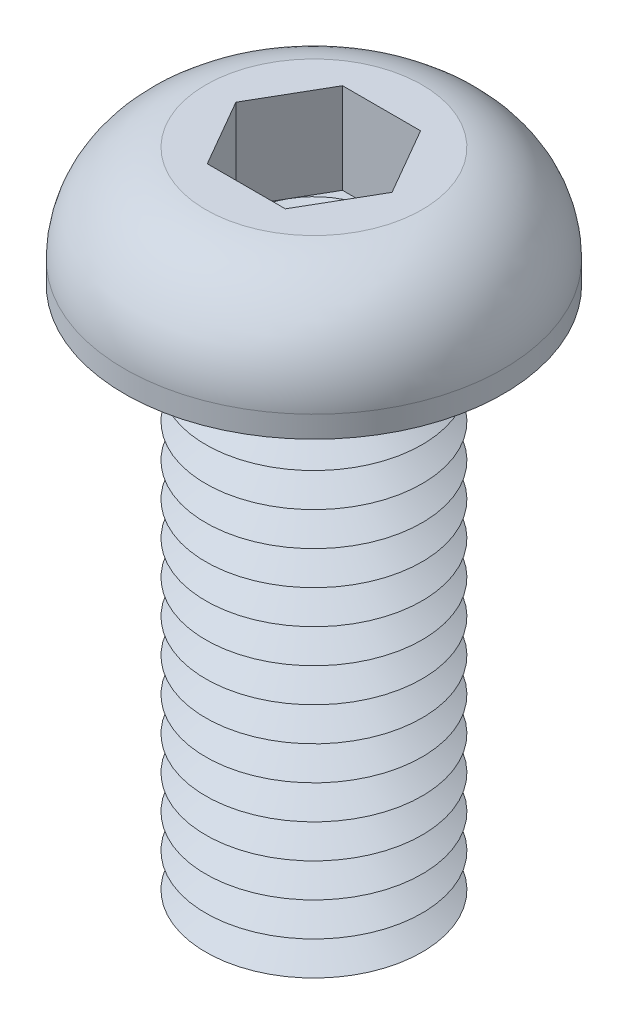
ISO-10303-21;
HEADER;
FILE_DESCRIPTION(('STEP AP214'),'2;1');
FILE_NAME('part.step','',(''),(''),'','','');
FILE_SCHEMA(('AUTOMOTIVE_DESIGN { 1 0 10303 214 1 1 1 1 }'));
ENDSEC;
DATA;
#1=APPLICATION_CONTEXT('core data for automotive mechanical design processes');
#2=APPLICATION_PROTOCOL_DEFINITION('international standard','automotive_design',2000,#1);
#3=PRODUCT_CONTEXT('',#1,'mechanical');
#4=PRODUCT('Part','Part','',(#3));
#5=PRODUCT_RELATED_PRODUCT_CATEGORY('part','',(#4));
#6=PRODUCT_DEFINITION_FORMATION('','',#4);
#7=PRODUCT_DEFINITION_CONTEXT('part definition',#1,'design');
#8=PRODUCT_DEFINITION('design','',#6,#7);
#9=PRODUCT_DEFINITION_SHAPE('','',#8);
#10=(LENGTH_UNIT() NAMED_UNIT(*) SI_UNIT(.MILLI.,.METRE.));
#11=(NAMED_UNIT(*) PLANE_ANGLE_UNIT() SI_UNIT($,.RADIAN.));
#12=(NAMED_UNIT(*) SI_UNIT($,.STERADIAN.) SOLID_ANGLE_UNIT());
#13=UNCERTAINTY_MEASURE_WITH_UNIT(LENGTH_MEASURE(1.E-05),#10,'distance_accuracy_value','');
#14=(GEOMETRIC_REPRESENTATION_CONTEXT(3) GLOBAL_UNCERTAINTY_ASSIGNED_CONTEXT((#13)) GLOBAL_UNIT_ASSIGNED_CONTEXT((#10,
#11,#12)) REPRESENTATION_CONTEXT('',''));
#15=CARTESIAN_POINT('',(0.,0.,0.));
#16=DIRECTION('',(0.,0.,1.));
#17=DIRECTION('',(1.,0.,0.));
#18=AXIS2_PLACEMENT_3D('',#15,#16,#17);
#19=CARTESIAN_POINT('',(0.,0.,0.));
#20=DIRECTION('',(0.,-1.,0.));
#21=DIRECTION('',(0.,0.,-1.));
#22=AXIS2_PLACEMENT_3D('',#19,#20,#21);
#23=TOROIDAL_SURFACE('',#22,4.625,0.625);
#24=CARTESIAN_POINT('',(0.,0.,-5.25));
#25=VERTEX_POINT('',#24);
#26=VERTEX_LOOP('',#25);
#27=FACE_BOUND('',#26,.T.);
#28=ADVANCED_FACE('P0_F12',(#27),#23,.T.);
#29=CLOSED_SHELL('',(#28));
#30=MANIFOLD_SOLID_BREP('P0_B1',#29);
#31=CARTESIAN_POINT('',(1.44337567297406,1.05,-2.5));
#32=DIRECTION('',(0.,1.,0.));
#33=DIRECTION('',(0.,0.,1.));
#34=AXIS2_PLACEMENT_3D('',#31,#32,#33);
#35=PLANE('',#34);
#36=CARTESIAN_POINT('',(0.,1.05,0.));
#37=DIRECTION('',(0.,1.,0.));
#38=DIRECTION('',(0.,0.,1.));
#39=AXIS2_PLACEMENT_3D('',#36,#37,#38);
#40=CIRCLE('',#39,2.5);
#41=CARTESIAN_POINT('',(0.,1.05,2.5));
#42=VERTEX_POINT('',#41);
#43=CARTESIAN_POINT('',(2.1650635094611,1.05,1.25));
#44=VERTEX_POINT('',#43);
#45=EDGE_CURVE('P1_E93',#42,#44,#40,.T.);
#46=ORIENTED_EDGE('',*,*,#45,.F.);
#47=DIRECTION('',(1.,0.,0.));
#48=VECTOR('',#47,1.);
#49=CARTESIAN_POINT('',(-1.44337567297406,1.05,2.5));
#50=LINE('',#49,#48);
#51=CARTESIAN_POINT('',(1.44337567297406,1.05,2.5));
#52=VERTEX_POINT('',#51);
#53=EDGE_CURVE('P1_E116',#42,#52,#50,.T.);
#54=ORIENTED_EDGE('',*,*,#53,.T.);
#55=DIRECTION('',(0.5,0.,-0.866025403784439));
#56=VECTOR('',#55,1.);
#57=CARTESIAN_POINT('',(1.44337567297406,1.05,2.5));
#58=LINE('',#57,#56);
#59=EDGE_CURVE('P1_E112',#52,#44,#58,.T.);
#60=ORIENTED_EDGE('',*,*,#59,.T.);
#61=EDGE_LOOP('',(#46,#54,#60));
#62=FACE_BOUND('',#61,.T.);
#63=ADVANCED_FACE('P1_F15',(#62),#35,.T.);
#64=CARTESIAN_POINT('',(0.,1.05,0.));
#65=DIRECTION('',(0.,1.,0.));
#66=DIRECTION('',(0.,0.,1.));
#67=AXIS2_PLACEMENT_3D('',#64,#65,#66);
#68=CIRCLE('',#67,2.5);
#69=CARTESIAN_POINT('',(2.1650635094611,1.05,-1.25));
#70=VERTEX_POINT('',#69);
#71=EDGE_CURVE('P1_E10',#44,#70,#68,.T.);
#72=ORIENTED_EDGE('',*,*,#71,.F.);
#73=CARTESIAN_POINT('',(2.88675134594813,1.05,0.));
#74=VERTEX_POINT('',#73);
#75=EDGE_CURVE('P1_E104',#44,#74,#58,.T.);
#76=ORIENTED_EDGE('',*,*,#75,.T.);
#77=DIRECTION('',(-0.5,0.,-0.866025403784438));
#78=VECTOR('',#77,1.);
#79=CARTESIAN_POINT('',(2.88675134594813,1.05,0.));
#80=LINE('',#79,#78);
#81=EDGE_CURVE('P1_E107',#74,#70,#80,.T.);
#82=ORIENTED_EDGE('',*,*,#81,.T.);
#83=EDGE_LOOP('',(#72,#76,#82));
#84=FACE_BOUND('',#83,.T.);
#85=ADVANCED_FACE('P1_F103',(#84),#35,.T.);
#86=CARTESIAN_POINT('',(0.,1.05,-2.5));
#87=VERTEX_POINT('',#86);
#88=EDGE_CURVE('P1_E24',#70,#87,#68,.T.);
#89=ORIENTED_EDGE('',*,*,#88,.F.);
#90=CARTESIAN_POINT('',(1.44337567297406,1.05,-2.5));
#91=VERTEX_POINT('',#90);
#92=EDGE_CURVE('P1_E139',#70,#91,#80,.T.);
#93=ORIENTED_EDGE('',*,*,#92,.T.);
#94=DIRECTION('',(-1.,0.,0.));
#95=VECTOR('',#94,1.);
#96=CARTESIAN_POINT('',(1.44337567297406,1.05,-2.5));
#97=LINE('',#96,#95);
#98=EDGE_CURVE('P1_E312',#91,#87,#97,.T.);
#99=ORIENTED_EDGE('',*,*,#98,.T.);
#100=EDGE_LOOP('',(#89,#93,#99));
#101=FACE_BOUND('',#100,.T.);
#102=ADVANCED_FACE('P1_F277',(#101),#35,.T.);
#103=CARTESIAN_POINT('',(-2.1650635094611,1.05,-1.25));
#104=VERTEX_POINT('',#103);
#105=EDGE_CURVE('P1_E307',#87,#104,#68,.T.);
#106=ORIENTED_EDGE('',*,*,#105,.F.);
#107=CARTESIAN_POINT('',(-1.44337567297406,1.05,-2.5));
#108=VERTEX_POINT('',#107);
#109=EDGE_CURVE('P1_E316',#87,#108,#97,.T.);
#110=ORIENTED_EDGE('',*,*,#109,.T.);
#111=DIRECTION('',(-0.5,0.,0.866025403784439));
#112=VECTOR('',#111,1.);
#113=CARTESIAN_POINT('',(-1.44337567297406,1.05,-2.5));
#114=LINE('',#113,#112);
#115=EDGE_CURVE('P1_E311',#108,#104,#114,.T.);
#116=ORIENTED_EDGE('',*,*,#115,.T.);
#117=EDGE_LOOP('',(#106,#110,#116));
#118=FACE_BOUND('',#117,.T.);
#119=ADVANCED_FACE('P1_F291',(#118),#35,.T.);
#120=CARTESIAN_POINT('',(-2.1650635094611,1.05,1.25));
#121=VERTEX_POINT('',#120);
#122=EDGE_CURVE('P1_E31',#104,#121,#68,.T.);
#123=ORIENTED_EDGE('',*,*,#122,.F.);
#124=CARTESIAN_POINT('',(-2.88675134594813,1.05,0.));
#125=VERTEX_POINT('',#124);
#126=EDGE_CURVE('P1_E303',#104,#125,#114,.T.);
#127=ORIENTED_EDGE('',*,*,#126,.T.);
#128=DIRECTION('',(0.5,0.,0.866025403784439));
#129=VECTOR('',#128,1.);
#130=CARTESIAN_POINT('',(-2.88675134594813,1.05,0.));
#131=LINE('',#130,#129);
#132=EDGE_CURVE('P1_E306',#125,#121,#131,.T.);
#133=ORIENTED_EDGE('',*,*,#132,.T.);
#134=EDGE_LOOP('',(#123,#127,#133));
#135=FACE_BOUND('',#134,.T.);
#136=ADVANCED_FACE('P1_F282',(#135),#35,.T.);
#137=CARTESIAN_POINT('',(0.,-18.75,0.));
#138=DIRECTION('',(0.,1.,0.));
#139=DIRECTION('',(0.,0.,1.));
#140=AXIS2_PLACEMENT_3D('',#137,#138,#139);
#141=CONICAL_SURFACE('',#140,2.91746824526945,1.0471975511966);
#142=CARTESIAN_POINT('',(0.,-18.125,0.));
#143=DIRECTION('',(0.,-1.,0.));
#144=DIRECTION('',(0.,0.,-1.));
#145=AXIS2_PLACEMENT_3D('',#142,#143,#144);
#146=CIRCLE('',#145,4.);
#147=CARTESIAN_POINT('',(0.,-18.125,-4.));
#148=VERTEX_POINT('',#147);
#149=EDGE_CURVE('P1_E239',#148,#148,#146,.T.);
#150=ORIENTED_EDGE('',*,*,#149,.T.);
#151=EDGE_LOOP('',(#150));
#152=FACE_BOUND('',#151,.T.);
#153=CARTESIAN_POINT('',(0.,-18.75,0.));
#154=DIRECTION('',(0.,-1.,0.));
#155=DIRECTION('',(0.,0.,-1.));
#156=AXIS2_PLACEMENT_3D('',#153,#154,#155);
#157=CIRCLE('',#156,2.91746824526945);
#158=CARTESIAN_POINT('',(0.,-18.75,-2.91746824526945));
#159=VERTEX_POINT('',#158);
#160=EDGE_CURVE('P1_E242',#159,#159,#157,.T.);
#161=ORIENTED_EDGE('',*,*,#160,.F.);
#162=EDGE_LOOP('',(#161));
#163=FACE_BOUND('',#162,.T.);
#164=ADVANCED_FACE('P1_F290',(#152,#163),#141,.T.);
#165=CARTESIAN_POINT('',(0.,-19.375,0.));
#166=DIRECTION('',(0.,-1.,0.));
#167=DIRECTION('',(0.,0.,-1.));
#168=AXIS2_PLACEMENT_3D('',#165,#166,#167);
#169=CONICAL_SURFACE('',#168,4.,1.0471975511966);
#170=ORIENTED_EDGE('',*,*,#160,.T.);
#171=EDGE_LOOP('',(#170));
#172=FACE_BOUND('',#171,.T.);
#173=CARTESIAN_POINT('',(0.,-19.375,0.));
#174=DIRECTION('',(0.,-1.,0.));
#175=DIRECTION('',(0.,0.,-1.));
#176=AXIS2_PLACEMENT_3D('',#173,#174,#175);
#177=CIRCLE('',#176,4.);
#178=CARTESIAN_POINT('',(0.,-19.375,-4.));
#179=VERTEX_POINT('',#178);
#180=EDGE_CURVE('P1_E245',#179,#179,#177,.T.);
#181=ORIENTED_EDGE('',*,*,#180,.F.);
#182=EDGE_LOOP('',(#181));
#183=FACE_BOUND('',#182,.T.);
#184=ADVANCED_FACE('P1_F297',(#172,#183),#169,.T.);
#185=CARTESIAN_POINT('',(0.,-20.,0.));
#186=DIRECTION('',(0.,1.,0.));
#187=DIRECTION('',(0.,0.,1.));
#188=AXIS2_PLACEMENT_3D('',#185,#186,#187);
#189=PLANE('',#188);
#190=CARTESIAN_POINT('',(0.,-20.,0.));
#191=DIRECTION('',(0.,-1.,0.));
#192=DIRECTION('',(0.,0.,-1.));
#193=AXIS2_PLACEMENT_3D('',#190,#191,#192);
#194=CIRCLE('',#193,2.91746824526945);
#195=CARTESIAN_POINT('',(0.,-20.,-2.91746824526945));
#196=VERTEX_POINT('',#195);
#197=EDGE_CURVE('P1_E248',#196,#196,#194,.T.);
#198=ORIENTED_EDGE('',*,*,#197,.T.);
#199=EDGE_LOOP('',(#198));
#200=FACE_BOUND('',#199,.T.);
#201=ADVANCED_FACE('P1_F375',(#200),#189,.F.);
#202=CARTESIAN_POINT('',(0.,-20.,0.));
#203=DIRECTION('',(0.,1.,0.));
#204=DIRECTION('',(0.,0.,1.));
#205=AXIS2_PLACEMENT_3D('',#202,#203,#204);
#206=CONICAL_SURFACE('',#205,2.91746824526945,1.0471975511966);
#207=ORIENTED_EDGE('',*,*,#180,.T.);
#208=EDGE_LOOP('',(#207));
#209=FACE_BOUND('',#208,.T.);
#210=ORIENTED_EDGE('',*,*,#197,.F.);
#211=EDGE_LOOP('',(#210));
#212=FACE_BOUND('',#211,.T.);
#213=ADVANCED_FACE('P1_F386',(#209,#212),#206,.T.);
#214=CARTESIAN_POINT('',(0.,-17.5,0.));
#215=DIRECTION('',(0.,1.,0.));
#216=DIRECTION('',(0.,0.,1.));
#217=AXIS2_PLACEMENT_3D('',#214,#215,#216);
#218=CONICAL_SURFACE('',#217,2.91746824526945,1.0471975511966);
#219=CARTESIAN_POINT('',(0.,-16.875,0.));
#220=DIRECTION('',(0.,-1.,0.));
#221=DIRECTION('',(0.,0.,-1.));
#222=AXIS2_PLACEMENT_3D('',#219,#220,#221);
#223=CIRCLE('',#222,4.);
#224=CARTESIAN_POINT('',(0.,-16.875,-4.));
#225=VERTEX_POINT('',#224);
#226=EDGE_CURVE('P1_E233',#225,#225,#223,.T.);
#227=ORIENTED_EDGE('',*,*,#226,.T.);
#228=EDGE_LOOP('',(#227));
#229=FACE_BOUND('',#228,.T.);
#230=CARTESIAN_POINT('',(0.,-17.5,0.));
#231=DIRECTION('',(0.,-1.,0.));
#232=DIRECTION('',(0.,0.,-1.));
#233=AXIS2_PLACEMENT_3D('',#230,#231,#232);
#234=CIRCLE('',#233,2.91746824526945);
#235=CARTESIAN_POINT('',(0.,-17.5,-2.91746824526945));
#236=VERTEX_POINT('',#235);
#237=EDGE_CURVE('P1_E236',#236,#236,#234,.T.);
#238=ORIENTED_EDGE('',*,*,#237,.F.);
#239=EDGE_LOOP('',(#238));
#240=FACE_BOUND('',#239,.T.);
#241=ADVANCED_FACE('P1_F395',(#229,#240),#218,.T.);
#242=CARTESIAN_POINT('',(0.,-18.125,0.));
#243=DIRECTION('',(0.,-1.,0.));
#244=DIRECTION('',(0.,0.,-1.));
#245=AXIS2_PLACEMENT_3D('',#242,#243,#244);
#246=CONICAL_SURFACE('',#245,4.,1.0471975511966);
#247=ORIENTED_EDGE('',*,*,#237,.T.);
#248=EDGE_LOOP('',(#247));
#249=FACE_BOUND('',#248,.T.);
#250=ORIENTED_EDGE('',*,*,#149,.F.);
#251=EDGE_LOOP('',(#250));
#252=FACE_BOUND('',#251,.T.);
#253=ADVANCED_FACE('P1_F404',(#249,#252),#246,.T.);
#254=CARTESIAN_POINT('',(0.,-16.25,0.));
#255=DIRECTION('',(0.,1.,0.));
#256=DIRECTION('',(0.,0.,1.));
#257=AXIS2_PLACEMENT_3D('',#254,#255,#256);
#258=CONICAL_SURFACE('',#257,2.91746824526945,1.0471975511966);
#259=CARTESIAN_POINT('',(0.,-15.625,0.));
#260=DIRECTION('',(0.,-1.,0.));
#261=DIRECTION('',(0.,0.,-1.));
#262=AXIS2_PLACEMENT_3D('',#259,#260,#261);
#263=CIRCLE('',#262,4.);
#264=CARTESIAN_POINT('',(0.,-15.625,-4.));
#265=VERTEX_POINT('',#264);
#266=EDGE_CURVE('P1_E227',#265,#265,#263,.T.);
#267=ORIENTED_EDGE('',*,*,#266,.T.);
#268=EDGE_LOOP('',(#267));
#269=FACE_BOUND('',#268,.T.);
#270=CARTESIAN_POINT('',(0.,-16.25,0.));
#271=DIRECTION('',(0.,-1.,0.));
#272=DIRECTION('',(0.,0.,-1.));
#273=AXIS2_PLACEMENT_3D('',#270,#271,#272);
#274=CIRCLE('',#273,2.91746824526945);
#275=CARTESIAN_POINT('',(0.,-16.25,-2.91746824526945));
#276=VERTEX_POINT('',#275);
#277=EDGE_CURVE('P1_E230',#276,#276,#274,.T.);
#278=ORIENTED_EDGE('',*,*,#277,.F.);
#279=EDGE_LOOP('',(#278));
#280=FACE_BOUND('',#279,.T.);
#281=ADVANCED_FACE('P1_F414',(#269,#280),#258,.T.);
#282=CARTESIAN_POINT('',(0.,-16.875,0.));
#283=DIRECTION('',(0.,-1.,0.));
#284=DIRECTION('',(0.,0.,-1.));
#285=AXIS2_PLACEMENT_3D('',#282,#283,#284);
#286=CONICAL_SURFACE('',#285,4.,1.0471975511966);
#287=ORIENTED_EDGE('',*,*,#277,.T.);
#288=EDGE_LOOP('',(#287));
#289=FACE_BOUND('',#288,.T.);
#290=ORIENTED_EDGE('',*,*,#226,.F.);
#291=EDGE_LOOP('',(#290));
#292=FACE_BOUND('',#291,.T.);
#293=ADVANCED_FACE('P1_F424',(#289,#292),#286,.T.);
#294=CARTESIAN_POINT('',(0.,-15.,0.));
#295=DIRECTION('',(0.,1.,0.));
#296=DIRECTION('',(0.,0.,1.));
#297=AXIS2_PLACEMENT_3D('',#294,#295,#296);
#298=CONICAL_SURFACE('',#297,2.91746824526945,1.0471975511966);
#299=CARTESIAN_POINT('',(0.,-14.375,0.));
#300=DIRECTION('',(0.,-1.,0.));
#301=DIRECTION('',(0.,0.,-1.));
#302=AXIS2_PLACEMENT_3D('',#299,#300,#301);
#303=CIRCLE('',#302,4.);
#304=CARTESIAN_POINT('',(0.,-14.375,-4.));
#305=VERTEX_POINT('',#304);
#306=EDGE_CURVE('P1_E221',#305,#305,#303,.T.);
#307=ORIENTED_EDGE('',*,*,#306,.T.);
#308=EDGE_LOOP('',(#307));
#309=FACE_BOUND('',#308,.T.);
#310=CARTESIAN_POINT('',(0.,-15.,0.));
#311=DIRECTION('',(0.,-1.,0.));
#312=DIRECTION('',(0.,0.,-1.));
#313=AXIS2_PLACEMENT_3D('',#310,#311,#312);
#314=CIRCLE('',#313,2.91746824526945);
#315=CARTESIAN_POINT('',(0.,-15.,-2.91746824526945));
#316=VERTEX_POINT('',#315);
#317=EDGE_CURVE('P1_E224',#316,#316,#314,.T.);
#318=ORIENTED_EDGE('',*,*,#317,.F.);
#319=EDGE_LOOP('',(#318));
#320=FACE_BOUND('',#319,.T.);
#321=ADVANCED_FACE('P1_F434',(#309,#320),#298,.T.);
#322=CARTESIAN_POINT('',(0.,-15.625,0.));
#323=DIRECTION('',(0.,-1.,0.));
#324=DIRECTION('',(0.,0.,-1.));
#325=AXIS2_PLACEMENT_3D('',#322,#323,#324);
#326=CONICAL_SURFACE('',#325,4.,1.0471975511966);
#327=ORIENTED_EDGE('',*,*,#317,.T.);
#328=EDGE_LOOP('',(#327));
#329=FACE_BOUND('',#328,.T.);
#330=ORIENTED_EDGE('',*,*,#266,.F.);
#331=EDGE_LOOP('',(#330));
#332=FACE_BOUND('',#331,.T.);
#333=ADVANCED_FACE('P1_F444',(#329,#332),#326,.T.);
#334=CARTESIAN_POINT('',(0.,-13.75,0.));
#335=DIRECTION('',(0.,1.,0.));
#336=DIRECTION('',(0.,0.,1.));
#337=AXIS2_PLACEMENT_3D('',#334,#335,#336);
#338=CONICAL_SURFACE('',#337,2.91746824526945,1.0471975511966);
#339=CARTESIAN_POINT('',(0.,-13.125,0.));
#340=DIRECTION('',(0.,-1.,0.));
#341=DIRECTION('',(0.,0.,-1.));
#342=AXIS2_PLACEMENT_3D('',#339,#340,#341);
#343=CIRCLE('',#342,4.);
#344=CARTESIAN_POINT('',(0.,-13.125,-4.));
#345=VERTEX_POINT('',#344);
#346=EDGE_CURVE('P1_E215',#345,#345,#343,.T.);
#347=ORIENTED_EDGE('',*,*,#346,.T.);
#348=EDGE_LOOP('',(#347));
#349=FACE_BOUND('',#348,.T.);
#350=CARTESIAN_POINT('',(0.,-13.75,0.));
#351=DIRECTION('',(0.,-1.,0.));
#352=DIRECTION('',(0.,0.,-1.));
#353=AXIS2_PLACEMENT_3D('',#350,#351,#352);
#354=CIRCLE('',#353,2.91746824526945);
#355=CARTESIAN_POINT('',(0.,-13.75,-2.91746824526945));
#356=VERTEX_POINT('',#355);
#357=EDGE_CURVE('P1_E218',#356,#356,#354,.T.);
#358=ORIENTED_EDGE('',*,*,#357,.F.);
#359=EDGE_LOOP('',(#358));
#360=FACE_BOUND('',#359,.T.);
#361=ADVANCED_FACE('P1_F454',(#349,#360),#338,.T.);
#362=CARTESIAN_POINT('',(0.,-14.375,0.));
#363=DIRECTION('',(0.,-1.,0.));
#364=DIRECTION('',(0.,0.,-1.));
#365=AXIS2_PLACEMENT_3D('',#362,#363,#364);
#366=CONICAL_SURFACE('',#365,4.,1.0471975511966);
#367=ORIENTED_EDGE('',*,*,#357,.T.);
#368=EDGE_LOOP('',(#367));
#369=FACE_BOUND('',#368,.T.);
#370=ORIENTED_EDGE('',*,*,#306,.F.);
#371=EDGE_LOOP('',(#370));
#372=FACE_BOUND('',#371,.T.);
#373=ADVANCED_FACE('P1_F464',(#369,#372),#366,.T.);
#374=CARTESIAN_POINT('',(0.,-12.5,0.));
#375=DIRECTION('',(0.,1.,0.));
#376=DIRECTION('',(0.,0.,1.));
#377=AXIS2_PLACEMENT_3D('',#374,#375,#376);
#378=CONICAL_SURFACE('',#377,2.91746824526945,1.0471975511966);
#379=CARTESIAN_POINT('',(0.,-11.875,0.));
#380=DIRECTION('',(0.,-1.,0.));
#381=DIRECTION('',(0.,0.,-1.));
#382=AXIS2_PLACEMENT_3D('',#379,#380,#381);
#383=CIRCLE('',#382,4.);
#384=CARTESIAN_POINT('',(0.,-11.875,-4.));
#385=VERTEX_POINT('',#384);
#386=EDGE_CURVE('P1_E209',#385,#385,#383,.T.);
#387=ORIENTED_EDGE('',*,*,#386,.T.);
#388=EDGE_LOOP('',(#387));
#389=FACE_BOUND('',#388,.T.);
#390=CARTESIAN_POINT('',(0.,-12.5,0.));
#391=DIRECTION('',(0.,-1.,0.));
#392=DIRECTION('',(0.,0.,-1.));
#393=AXIS2_PLACEMENT_3D('',#390,#391,#392);
#394=CIRCLE('',#393,2.91746824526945);
#395=CARTESIAN_POINT('',(0.,-12.5,-2.91746824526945));
#396=VERTEX_POINT('',#395);
#397=EDGE_CURVE('P1_E212',#396,#396,#394,.T.);
#398=ORIENTED_EDGE('',*,*,#397,.F.);
#399=EDGE_LOOP('',(#398));
#400=FACE_BOUND('',#399,.T.);
#401=ADVANCED_FACE('P1_F474',(#389,#400),#378,.T.);
#402=CARTESIAN_POINT('',(0.,-13.125,0.));
#403=DIRECTION('',(0.,-1.,0.));
#404=DIRECTION('',(0.,0.,-1.));
#405=AXIS2_PLACEMENT_3D('',#402,#403,#404);
#406=CONICAL_SURFACE('',#405,4.,1.0471975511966);
#407=ORIENTED_EDGE('',*,*,#397,.T.);
#408=EDGE_LOOP('',(#407));
#409=FACE_BOUND('',#408,.T.);
#410=ORIENTED_EDGE('',*,*,#346,.F.);
#411=EDGE_LOOP('',(#410));
#412=FACE_BOUND('',#411,.T.);
#413=ADVANCED_FACE('P1_F484',(#409,#412),#406,.T.);
#414=CARTESIAN_POINT('',(0.,-11.25,0.));
#415=DIRECTION('',(0.,1.,0.));
#416=DIRECTION('',(0.,0.,1.));
#417=AXIS2_PLACEMENT_3D('',#414,#415,#416);
#418=CONICAL_SURFACE('',#417,2.91746824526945,1.0471975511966);
#419=CARTESIAN_POINT('',(0.,-10.625,0.));
#420=DIRECTION('',(0.,-1.,0.));
#421=DIRECTION('',(0.,0.,-1.));
#422=AXIS2_PLACEMENT_3D('',#419,#420,#421);
#423=CIRCLE('',#422,4.);
#424=CARTESIAN_POINT('',(0.,-10.625,-4.));
#425=VERTEX_POINT('',#424);
#426=EDGE_CURVE('P1_E203',#425,#425,#423,.T.);
#427=ORIENTED_EDGE('',*,*,#426,.T.);
#428=EDGE_LOOP('',(#427));
#429=FACE_BOUND('',#428,.T.);
#430=CARTESIAN_POINT('',(0.,-11.25,0.));
#431=DIRECTION('',(0.,-1.,0.));
#432=DIRECTION('',(0.,0.,-1.));
#433=AXIS2_PLACEMENT_3D('',#430,#431,#432);
#434=CIRCLE('',#433,2.91746824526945);
#435=CARTESIAN_POINT('',(0.,-11.25,-2.91746824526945));
#436=VERTEX_POINT('',#435);
#437=EDGE_CURVE('P1_E206',#436,#436,#434,.T.);
#438=ORIENTED_EDGE('',*,*,#437,.F.);
#439=EDGE_LOOP('',(#438));
#440=FACE_BOUND('',#439,.T.);
#441=ADVANCED_FACE('P1_F494',(#429,#440),#418,.T.);
#442=CARTESIAN_POINT('',(0.,-11.875,0.));
#443=DIRECTION('',(0.,-1.,0.));
#444=DIRECTION('',(0.,0.,-1.));
#445=AXIS2_PLACEMENT_3D('',#442,#443,#444);
#446=CONICAL_SURFACE('',#445,4.,1.0471975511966);
#447=ORIENTED_EDGE('',*,*,#437,.T.);
#448=EDGE_LOOP('',(#447));
#449=FACE_BOUND('',#448,.T.);
#450=ORIENTED_EDGE('',*,*,#386,.F.);
#451=EDGE_LOOP('',(#450));
#452=FACE_BOUND('',#451,.T.);
#453=ADVANCED_FACE('P1_F504',(#449,#452),#446,.T.);
#454=CARTESIAN_POINT('',(0.,-10.,0.));
#455=DIRECTION('',(0.,1.,0.));
#456=DIRECTION('',(0.,0.,1.));
#457=AXIS2_PLACEMENT_3D('',#454,#455,#456);
#458=CONICAL_SURFACE('',#457,2.91746824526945,1.0471975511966);
#459=CARTESIAN_POINT('',(0.,-9.375,0.));
#460=DIRECTION('',(0.,-1.,0.));
#461=DIRECTION('',(0.,0.,-1.));
#462=AXIS2_PLACEMENT_3D('',#459,#460,#461);
#463=CIRCLE('',#462,4.);
#464=CARTESIAN_POINT('',(0.,-9.375,-4.));
#465=VERTEX_POINT('',#464);
#466=EDGE_CURVE('P1_E197',#465,#465,#463,.T.);
#467=ORIENTED_EDGE('',*,*,#466,.T.);
#468=EDGE_LOOP('',(#467));
#469=FACE_BOUND('',#468,.T.);
#470=CARTESIAN_POINT('',(0.,-10.,0.));
#471=DIRECTION('',(0.,-1.,0.));
#472=DIRECTION('',(0.,0.,-1.));
#473=AXIS2_PLACEMENT_3D('',#470,#471,#472);
#474=CIRCLE('',#473,2.91746824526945);
#475=CARTESIAN_POINT('',(0.,-10.,-2.91746824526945));
#476=VERTEX_POINT('',#475);
#477=EDGE_CURVE('P1_E200',#476,#476,#474,.T.);
#478=ORIENTED_EDGE('',*,*,#477,.F.);
#479=EDGE_LOOP('',(#478));
#480=FACE_BOUND('',#479,.T.);
#481=ADVANCED_FACE('P1_F514',(#469,#480),#458,.T.);
#482=CARTESIAN_POINT('',(0.,-10.625,0.));
#483=DIRECTION('',(0.,-1.,0.));
#484=DIRECTION('',(0.,0.,-1.));
#485=AXIS2_PLACEMENT_3D('',#482,#483,#484);
#486=CONICAL_SURFACE('',#485,4.,1.0471975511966);
#487=ORIENTED_EDGE('',*,*,#477,.T.);
#488=EDGE_LOOP('',(#487));
#489=FACE_BOUND('',#488,.T.);
#490=ORIENTED_EDGE('',*,*,#426,.F.);
#491=EDGE_LOOP('',(#490));
#492=FACE_BOUND('',#491,.T.);
#493=ADVANCED_FACE('P1_F524',(#489,#492),#486,.T.);
#494=CARTESIAN_POINT('',(0.,-8.75,0.));
#495=DIRECTION('',(0.,1.,0.));
#496=DIRECTION('',(0.,0.,1.));
#497=AXIS2_PLACEMENT_3D('',#494,#495,#496);
#498=CONICAL_SURFACE('',#497,2.91746824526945,1.0471975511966);
#499=CARTESIAN_POINT('',(0.,-8.125,0.));
#500=DIRECTION('',(0.,-1.,0.));
#501=DIRECTION('',(0.,0.,-1.));
#502=AXIS2_PLACEMENT_3D('',#499,#500,#501);
#503=CIRCLE('',#502,4.);
#504=CARTESIAN_POINT('',(0.,-8.125,-4.));
#505=VERTEX_POINT('',#504);
#506=EDGE_CURVE('P1_E191',#505,#505,#503,.T.);
#507=ORIENTED_EDGE('',*,*,#506,.T.);
#508=EDGE_LOOP('',(#507));
#509=FACE_BOUND('',#508,.T.);
#510=CARTESIAN_POINT('',(0.,-8.75,0.));
#511=DIRECTION('',(0.,-1.,0.));
#512=DIRECTION('',(0.,0.,-1.));
#513=AXIS2_PLACEMENT_3D('',#510,#511,#512);
#514=CIRCLE('',#513,2.91746824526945);
#515=CARTESIAN_POINT('',(0.,-8.75,-2.91746824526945));
#516=VERTEX_POINT('',#515);
#517=EDGE_CURVE('P1_E194',#516,#516,#514,.T.);
#518=ORIENTED_EDGE('',*,*,#517,.F.);
#519=EDGE_LOOP('',(#518));
#520=FACE_BOUND('',#519,.T.);
#521=ADVANCED_FACE('P1_F534',(#509,#520),#498,.T.);
#522=CARTESIAN_POINT('',(0.,-9.375,0.));
#523=DIRECTION('',(0.,-1.,0.));
#524=DIRECTION('',(0.,0.,-1.));
#525=AXIS2_PLACEMENT_3D('',#522,#523,#524);
#526=CONICAL_SURFACE('',#525,4.,1.0471975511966);
#527=ORIENTED_EDGE('',*,*,#517,.T.);
#528=EDGE_LOOP('',(#527));
#529=FACE_BOUND('',#528,.T.);
#530=ORIENTED_EDGE('',*,*,#466,.F.);
#531=EDGE_LOOP('',(#530));
#532=FACE_BOUND('',#531,.T.);
#533=ADVANCED_FACE('P1_F544',(#529,#532),#526,.T.);
#534=CARTESIAN_POINT('',(0.,-7.5,0.));
#535=DIRECTION('',(0.,1.,0.));
#536=DIRECTION('',(0.,0.,1.));
#537=AXIS2_PLACEMENT_3D('',#534,#535,#536);
#538=CONICAL_SURFACE('',#537,2.91746824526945,1.0471975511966);
#539=CARTESIAN_POINT('',(0.,-6.875,0.));
#540=DIRECTION('',(0.,-1.,0.));
#541=DIRECTION('',(0.,0.,-1.));
#542=AXIS2_PLACEMENT_3D('',#539,#540,#541);
#543=CIRCLE('',#542,4.);
#544=CARTESIAN_POINT('',(0.,-6.875,-4.));
#545=VERTEX_POINT('',#544);
#546=EDGE_CURVE('P1_E185',#545,#545,#543,.T.);
#547=ORIENTED_EDGE('',*,*,#546,.T.);
#548=EDGE_LOOP('',(#547));
#549=FACE_BOUND('',#548,.T.);
#550=CARTESIAN_POINT('',(0.,-7.5,0.));
#551=DIRECTION('',(0.,-1.,0.));
#552=DIRECTION('',(0.,0.,-1.));
#553=AXIS2_PLACEMENT_3D('',#550,#551,#552);
#554=CIRCLE('',#553,2.91746824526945);
#555=CARTESIAN_POINT('',(0.,-7.5,-2.91746824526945));
#556=VERTEX_POINT('',#555);
#557=EDGE_CURVE('P1_E188',#556,#556,#554,.T.);
#558=ORIENTED_EDGE('',*,*,#557,.F.);
#559=EDGE_LOOP('',(#558));
#560=FACE_BOUND('',#559,.T.);
#561=ADVANCED_FACE('P1_F554',(#549,#560),#538,.T.);
#562=CARTESIAN_POINT('',(0.,-8.125,0.));
#563=DIRECTION('',(0.,-1.,0.));
#564=DIRECTION('',(0.,0.,-1.));
#565=AXIS2_PLACEMENT_3D('',#562,#563,#564);
#566=CONICAL_SURFACE('',#565,4.,1.0471975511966);
#567=ORIENTED_EDGE('',*,*,#557,.T.);
#568=EDGE_LOOP('',(#567));
#569=FACE_BOUND('',#568,.T.);
#570=ORIENTED_EDGE('',*,*,#506,.F.);
#571=EDGE_LOOP('',(#570));
#572=FACE_BOUND('',#571,.T.);
#573=ADVANCED_FACE('P1_F564',(#569,#572),#566,.T.);
#574=CARTESIAN_POINT('',(0.,-6.25,0.));
#575=DIRECTION('',(0.,1.,0.));
#576=DIRECTION('',(0.,0.,1.));
#577=AXIS2_PLACEMENT_3D('',#574,#575,#576);
#578=CONICAL_SURFACE('',#577,2.91746824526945,1.0471975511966);
#579=CARTESIAN_POINT('',(0.,-5.625,0.));
#580=DIRECTION('',(0.,-1.,0.));
#581=DIRECTION('',(0.,0.,-1.));
#582=AXIS2_PLACEMENT_3D('',#579,#580,#581);
#583=CIRCLE('',#582,4.);
#584=CARTESIAN_POINT('',(0.,-5.625,-4.));
#585=VERTEX_POINT('',#584);
#586=EDGE_CURVE('P1_E179',#585,#585,#583,.T.);
#587=ORIENTED_EDGE('',*,*,#586,.T.);
#588=EDGE_LOOP('',(#587));
#589=FACE_BOUND('',#588,.T.);
#590=CARTESIAN_POINT('',(0.,-6.25,0.));
#591=DIRECTION('',(0.,-1.,0.));
#592=DIRECTION('',(0.,0.,-1.));
#593=AXIS2_PLACEMENT_3D('',#590,#591,#592);
#594=CIRCLE('',#593,2.91746824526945);
#595=CARTESIAN_POINT('',(0.,-6.25,-2.91746824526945));
#596=VERTEX_POINT('',#595);
#597=EDGE_CURVE('P1_E182',#596,#596,#594,.T.);
#598=ORIENTED_EDGE('',*,*,#597,.F.);
#599=EDGE_LOOP('',(#598));
#600=FACE_BOUND('',#599,.T.);
#601=ADVANCED_FACE('P1_F574',(#589,#600),#578,.T.);
#602=CARTESIAN_POINT('',(0.,-6.875,0.));
#603=DIRECTION('',(0.,-1.,0.));
#604=DIRECTION('',(0.,0.,-1.));
#605=AXIS2_PLACEMENT_3D('',#602,#603,#604);
#606=CONICAL_SURFACE('',#605,4.,1.0471975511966);
#607=ORIENTED_EDGE('',*,*,#597,.T.);
#608=EDGE_LOOP('',(#607));
#609=FACE_BOUND('',#608,.T.);
#610=ORIENTED_EDGE('',*,*,#546,.F.);
#611=EDGE_LOOP('',(#610));
#612=FACE_BOUND('',#611,.T.);
#613=ADVANCED_FACE('P1_F584',(#609,#612),#606,.T.);
#614=CARTESIAN_POINT('',(0.,-5.,0.));
#615=DIRECTION('',(0.,1.,0.));
#616=DIRECTION('',(0.,0.,1.));
#617=AXIS2_PLACEMENT_3D('',#614,#615,#616);
#618=CONICAL_SURFACE('',#617,2.91746824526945,1.0471975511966);
#619=CARTESIAN_POINT('',(0.,-4.375,0.));
#620=DIRECTION('',(0.,-1.,0.));
#621=DIRECTION('',(0.,0.,-1.));
#622=AXIS2_PLACEMENT_3D('',#619,#620,#621);
#623=CIRCLE('',#622,4.);
#624=CARTESIAN_POINT('',(0.,-4.375,-4.));
#625=VERTEX_POINT('',#624);
#626=EDGE_CURVE('P1_E173',#625,#625,#623,.T.);
#627=ORIENTED_EDGE('',*,*,#626,.T.);
#628=EDGE_LOOP('',(#627));
#629=FACE_BOUND('',#628,.T.);
#630=CARTESIAN_POINT('',(0.,-5.,0.));
#631=DIRECTION('',(0.,-1.,0.));
#632=DIRECTION('',(0.,0.,-1.));
#633=AXIS2_PLACEMENT_3D('',#630,#631,#632);
#634=CIRCLE('',#633,2.91746824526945);
#635=CARTESIAN_POINT('',(0.,-5.,-2.91746824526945));
#636=VERTEX_POINT('',#635);
#637=EDGE_CURVE('P1_E176',#636,#636,#634,.T.);
#638=ORIENTED_EDGE('',*,*,#637,.F.);
#639=EDGE_LOOP('',(#638));
#640=FACE_BOUND('',#639,.T.);
#641=ADVANCED_FACE('P1_F594',(#629,#640),#618,.T.);
#642=CARTESIAN_POINT('',(0.,-5.625,0.));
#643=DIRECTION('',(0.,-1.,0.));
#644=DIRECTION('',(0.,0.,-1.));
#645=AXIS2_PLACEMENT_3D('',#642,#643,#644);
#646=CONICAL_SURFACE('',#645,4.,1.0471975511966);
#647=ORIENTED_EDGE('',*,*,#637,.T.);
#648=EDGE_LOOP('',(#647));
#649=FACE_BOUND('',#648,.T.);
#650=ORIENTED_EDGE('',*,*,#586,.F.);
#651=EDGE_LOOP('',(#650));
#652=FACE_BOUND('',#651,.T.);
#653=ADVANCED_FACE('P1_F604',(#649,#652),#646,.T.);
#654=CARTESIAN_POINT('',(0.,-3.75,0.));
#655=DIRECTION('',(0.,1.,0.));
#656=DIRECTION('',(0.,0.,1.));
#657=AXIS2_PLACEMENT_3D('',#654,#655,#656);
#658=CONICAL_SURFACE('',#657,2.91746824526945,1.0471975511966);
#659=CARTESIAN_POINT('',(0.,-3.125,0.));
#660=DIRECTION('',(0.,-1.,0.));
#661=DIRECTION('',(0.,0.,-1.));
#662=AXIS2_PLACEMENT_3D('',#659,#660,#661);
#663=CIRCLE('',#662,4.);
#664=CARTESIAN_POINT('',(0.,-3.125,-4.));
#665=VERTEX_POINT('',#664);
#666=EDGE_CURVE('P1_E164',#665,#665,#663,.T.);
#667=ORIENTED_EDGE('',*,*,#666,.T.);
#668=EDGE_LOOP('',(#667));
#669=FACE_BOUND('',#668,.T.);
#670=CARTESIAN_POINT('',(0.,-3.75,0.));
#671=DIRECTION('',(0.,-1.,0.));
#672=DIRECTION('',(0.,0.,-1.));
#673=AXIS2_PLACEMENT_3D('',#670,#671,#672);
#674=CIRCLE('',#673,2.91746824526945);
#675=CARTESIAN_POINT('',(0.,-3.75,-2.91746824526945));
#676=VERTEX_POINT('',#675);
#677=EDGE_CURVE('P1_E170',#676,#676,#674,.T.);
#678=ORIENTED_EDGE('',*,*,#677,.F.);
#679=EDGE_LOOP('',(#678));
#680=FACE_BOUND('',#679,.T.);
#681=ADVANCED_FACE('P1_F614',(#669,#680),#658,.T.);
#682=CARTESIAN_POINT('',(0.,-4.375,0.));
#683=DIRECTION('',(0.,-1.,0.));
#684=DIRECTION('',(0.,0.,-1.));
#685=AXIS2_PLACEMENT_3D('',#682,#683,#684);
#686=CONICAL_SURFACE('',#685,4.,1.0471975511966);
#687=ORIENTED_EDGE('',*,*,#677,.T.);
#688=EDGE_LOOP('',(#687));
#689=FACE_BOUND('',#688,.T.);
#690=ORIENTED_EDGE('',*,*,#626,.F.);
#691=EDGE_LOOP('',(#690));
#692=FACE_BOUND('',#691,.T.);
#693=ADVANCED_FACE('P1_F624',(#689,#692),#686,.T.);
#694=CARTESIAN_POINT('',(0.,-2.5,0.));
#695=DIRECTION('',(0.,1.,0.));
#696=DIRECTION('',(0.,0.,1.));
#697=AXIS2_PLACEMENT_3D('',#694,#695,#696);
#698=CONICAL_SURFACE('',#697,2.91746824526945,1.0471975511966);
#699=CARTESIAN_POINT('',(0.,-1.875,0.));
#700=DIRECTION('',(0.,-1.,0.));
#701=DIRECTION('',(0.,0.,-1.));
#702=AXIS2_PLACEMENT_3D('',#699,#700,#701);
#703=CIRCLE('',#702,4.);
#704=CARTESIAN_POINT('',(0.,-1.875,-4.));
#705=VERTEX_POINT('',#704);
#706=EDGE_CURVE('P1_E167',#705,#705,#703,.T.);
#707=ORIENTED_EDGE('',*,*,#706,.T.);
#708=EDGE_LOOP('',(#707));
#709=FACE_BOUND('',#708,.T.);
#710=CARTESIAN_POINT('',(0.,-2.5,0.));
#711=DIRECTION('',(0.,-1.,0.));
#712=DIRECTION('',(0.,0.,-1.));
#713=AXIS2_PLACEMENT_3D('',#710,#711,#712);
#714=CIRCLE('',#713,2.91746824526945);
#715=CARTESIAN_POINT('',(0.,-2.5,-2.91746824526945));
#716=VERTEX_POINT('',#715);
#717=EDGE_CURVE('P1_E161',#716,#716,#714,.T.);
#718=ORIENTED_EDGE('',*,*,#717,.F.);
#719=EDGE_LOOP('',(#718));
#720=FACE_BOUND('',#719,.T.);
#721=ADVANCED_FACE('P1_F634',(#709,#720),#698,.T.);
#722=CARTESIAN_POINT('',(0.,-3.125,0.));
#723=DIRECTION('',(0.,-1.,0.));
#724=DIRECTION('',(0.,0.,-1.));
#725=AXIS2_PLACEMENT_3D('',#722,#723,#724);
#726=CONICAL_SURFACE('',#725,4.,1.0471975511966);
#727=ORIENTED_EDGE('',*,*,#717,.T.);
#728=EDGE_LOOP('',(#727));
#729=FACE_BOUND('',#728,.T.);
#730=ORIENTED_EDGE('',*,*,#666,.F.);
#731=EDGE_LOOP('',(#730));
#732=FACE_BOUND('',#731,.T.);
#733=ADVANCED_FACE('P1_F644',(#729,#732),#726,.T.);
#734=CARTESIAN_POINT('',(0.,-20.,0.));
#735=DIRECTION('',(0.,1.,0.));
#736=DIRECTION('',(0.,0.,1.));
#737=AXIS2_PLACEMENT_3D('',#734,#735,#736);
#738=CYLINDRICAL_SURFACE('',#737,4.);
#739=CARTESIAN_POINT('',(0.,0.,0.));
#740=DIRECTION('',(0.,-1.,0.));
#741=DIRECTION('',(1.,0.,0.));
#742=AXIS2_PLACEMENT_3D('',#739,#740,#741);
#743=CIRCLE('',#742,4.);
#744=CARTESIAN_POINT('',(4.,0.,0.));
#745=VERTEX_POINT('',#744);
#746=EDGE_CURVE('P1_E141',#745,#745,#743,.F.);
#747=ORIENTED_EDGE('',*,*,#746,.F.);
#748=EDGE_LOOP('',(#747));
#749=FACE_BOUND('',#748,.T.);
#750=ORIENTED_EDGE('',*,*,#706,.F.);
#751=EDGE_LOOP('',(#750));
#752=FACE_BOUND('',#751,.T.);
#753=ADVANCED_FACE('P1_F17',(#749,#752),#738,.T.);
#754=CARTESIAN_POINT('',(0.,0.,0.));
#755=DIRECTION('',(0.,-1.,0.));
#756=DIRECTION('',(0.,0.,-1.));
#757=AXIS2_PLACEMENT_3D('',#754,#755,#756);
#758=TOROIDAL_SURFACE('',#757,4.625,0.625);
#759=ORIENTED_EDGE('',*,*,#746,.T.);
#760=EDGE_LOOP('',(#759));
#761=FACE_BOUND('',#760,.T.);
#762=CARTESIAN_POINT('',(0.,0.,0.));
#763=DIRECTION('',(0.,1.,0.));
#764=DIRECTION('',(-1.,0.,0.));
#765=AXIS2_PLACEMENT_3D('',#762,#763,#764);
#766=CIRCLE('',#765,5.25);
#767=CARTESIAN_POINT('',(-5.25,0.,0.));
#768=VERTEX_POINT('',#767);
#769=EDGE_CURVE('P1_E151',#768,#768,#766,.F.);
#770=ORIENTED_EDGE('',*,*,#769,.T.);
#771=EDGE_LOOP('',(#770));
#772=FACE_BOUND('',#771,.T.);
#773=ADVANCED_FACE('P1_F253',(#761,#772),#758,.F.);
#774=CARTESIAN_POINT('',(4.,4.4,0.));
#775=DIRECTION('',(0.,-1.,0.));
#776=DIRECTION('',(1.,0.,0.));
#777=AXIS2_PLACEMENT_3D('',#774,#775,#776);
#778=PLANE('',#777);
#779=DIRECTION('',(-1.,0.,0.));
#780=VECTOR('',#779,1.);
#781=CARTESIAN_POINT('',(1.44337567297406,4.4,-2.5));
#782=LINE('',#781,#780);
#783=CARTESIAN_POINT('',(1.44337567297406,4.4,-2.5));
#784=VERTEX_POINT('',#783);
#785=CARTESIAN_POINT('',(-1.44337567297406,4.4,-2.5));
#786=VERTEX_POINT('',#785);
#787=EDGE_CURVE('P1_E125',#784,#786,#782,.T.);
#788=ORIENTED_EDGE('',*,*,#787,.F.);
#789=DIRECTION('',(-0.5,0.,-0.866025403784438));
#790=VECTOR('',#789,1.);
#791=CARTESIAN_POINT('',(2.88675134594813,4.4,0.));
#792=LINE('',#791,#790);
#793=CARTESIAN_POINT('',(2.88675134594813,4.4,0.));
#794=VERTEX_POINT('',#793);
#795=EDGE_CURVE('P1_E39',#794,#784,#792,.T.);
#796=ORIENTED_EDGE('',*,*,#795,.F.);
#797=DIRECTION('',(0.5,0.,-0.866025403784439));
#798=VECTOR('',#797,1.);
#799=CARTESIAN_POINT('',(1.44337567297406,4.4,2.5));
#800=LINE('',#799,#798);
#801=CARTESIAN_POINT('',(1.44337567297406,4.4,2.5));
#802=VERTEX_POINT('',#801);
#803=EDGE_CURVE('P1_E137',#802,#794,#800,.T.);
#804=ORIENTED_EDGE('',*,*,#803,.F.);
#805=DIRECTION('',(1.,0.,0.));
#806=VECTOR('',#805,1.);
#807=CARTESIAN_POINT('',(-1.44337567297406,4.4,2.5));
#808=LINE('',#807,#806);
#809=CARTESIAN_POINT('',(-1.44337567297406,4.4,2.5));
#810=VERTEX_POINT('',#809);
#811=EDGE_CURVE('P1_E134',#810,#802,#808,.T.);
#812=ORIENTED_EDGE('',*,*,#811,.F.);
#813=DIRECTION('',(0.5,0.,0.866025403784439));
#814=VECTOR('',#813,1.);
#815=CARTESIAN_POINT('',(-2.88675134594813,4.4,0.));
#816=LINE('',#815,#814);
#817=CARTESIAN_POINT('',(-2.88675134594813,4.4,0.));
#818=VERTEX_POINT('',#817);
#819=EDGE_CURVE('P1_E131',#818,#810,#816,.T.);
#820=ORIENTED_EDGE('',*,*,#819,.F.);
#821=DIRECTION('',(-0.5,0.,0.866025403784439));
#822=VECTOR('',#821,1.);
#823=CARTESIAN_POINT('',(-1.44337567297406,4.4,-2.5));
#824=LINE('',#823,#822);
#825=EDGE_CURVE('P1_E128',#786,#818,#824,.T.);
#826=ORIENTED_EDGE('',*,*,#825,.F.);
#827=EDGE_LOOP('',(#788,#796,#804,#812,#820,#826));
#828=FACE_BOUND('',#827,.T.);
#829=CARTESIAN_POINT('',(0.,4.4,0.));
#830=DIRECTION('',(0.,1.,0.));
#831=DIRECTION('',(-1.,0.,0.));
#832=AXIS2_PLACEMENT_3D('',#829,#830,#831);
#833=CIRCLE('',#832,4.);
#834=CARTESIAN_POINT('',(-4.,4.4,0.));
#835=VERTEX_POINT('',#834);
#836=EDGE_CURVE('P1_E152',#835,#835,#833,.T.);
#837=ORIENTED_EDGE('',*,*,#836,.T.);
#838=EDGE_LOOP('',(#837));
#839=FACE_BOUND('',#838,.T.);
#840=ADVANCED_FACE('P1_F331',(#828,#839),#778,.F.);
#841=CARTESIAN_POINT('',(0.,0.8,0.));
#842=DIRECTION('',(0.,1.,0.));
#843=DIRECTION('',(-1.,0.,0.));
#844=AXIS2_PLACEMENT_3D('',#841,#842,#843);
#845=DEGENERATE_TOROIDAL_SURFACE('',#844,3.34,3.66,.T.);
#846=ORIENTED_EDGE('',*,*,#836,.F.);
#847=EDGE_LOOP('',(#846));
#848=FACE_BOUND('',#847,.T.);
#849=CARTESIAN_POINT('',(0.,0.799999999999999,0.));
#850=DIRECTION('',(0.,1.,0.));
#851=DIRECTION('',(-1.,0.,0.));
#852=AXIS2_PLACEMENT_3D('',#849,#850,#851);
#853=CIRCLE('',#852,7.);
#854=CARTESIAN_POINT('',(-7.,0.799999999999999,0.));
#855=VERTEX_POINT('',#854);
#856=EDGE_CURVE('P1_E155',#855,#855,#853,.T.);
#857=ORIENTED_EDGE('',*,*,#856,.T.);
#858=EDGE_LOOP('',(#857));
#859=FACE_BOUND('',#858,.T.);
#860=ADVANCED_FACE('P1_F267',(#848,#859),#845,.T.);
#861=CARTESIAN_POINT('',(0.,4.4,0.));
#862=DIRECTION('',(0.,1.,0.));
#863=DIRECTION('',(-1.,0.,0.));
#864=AXIS2_PLACEMENT_3D('',#861,#862,#863);
#865=CYLINDRICAL_SURFACE('',#864,7.);
#866=ORIENTED_EDGE('',*,*,#856,.F.);
#867=EDGE_LOOP('',(#866));
#868=FACE_BOUND('',#867,.T.);
#869=CARTESIAN_POINT('',(0.,0.,0.));
#870=DIRECTION('',(0.,1.,0.));
#871=DIRECTION('',(-1.,0.,0.));
#872=AXIS2_PLACEMENT_3D('',#869,#870,#871);
#873=CIRCLE('',#872,7.);
#874=CARTESIAN_POINT('',(-7.,0.,0.));
#875=VERTEX_POINT('',#874);
#876=EDGE_CURVE('P1_E158',#875,#875,#873,.T.);
#877=ORIENTED_EDGE('',*,*,#876,.T.);
#878=EDGE_LOOP('',(#877));
#879=FACE_BOUND('',#878,.T.);
#880=ADVANCED_FACE('P1_F258',(#868,#879),#865,.T.);
#881=CARTESIAN_POINT('',(0.,0.,0.));
#882=DIRECTION('',(0.,1.,0.));
#883=DIRECTION('',(-1.,0.,0.));
#884=AXIS2_PLACEMENT_3D('',#881,#882,#883);
#885=PLANE('',#884);
#886=ORIENTED_EDGE('',*,*,#876,.F.);
#887=EDGE_LOOP('',(#886));
#888=FACE_BOUND('',#887,.T.);
#889=ORIENTED_EDGE('',*,*,#769,.F.);
#890=EDGE_LOOP('',(#889));
#891=FACE_BOUND('',#890,.T.);
#892=ADVANCED_FACE('P1_F255',(#888,#891),#885,.F.);
#893=CARTESIAN_POINT('',(2.88675134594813,1.05,0.));
#894=DIRECTION('',(0.866025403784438,0.,-0.5));
#895=DIRECTION('',(-0.5,0.,-0.866025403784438));
#896=AXIS2_PLACEMENT_3D('',#893,#894,#895);
#897=PLANE('',#896);
#898=ORIENTED_EDGE('',*,*,#795,.T.);
#899=DIRECTION('',(0.,1.,0.));
#900=VECTOR('',#899,1.);
#901=CARTESIAN_POINT('',(1.44337567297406,1.05,-2.5));
#902=LINE('',#901,#900);
#903=EDGE_CURVE('P1_E118',#91,#784,#902,.T.);
#904=ORIENTED_EDGE('',*,*,#903,.F.);
#905=ORIENTED_EDGE('',*,*,#92,.F.);
#906=ORIENTED_EDGE('',*,*,#81,.F.);
#907=DIRECTION('',(0.,1.,0.));
#908=VECTOR('',#907,1.);
#909=CARTESIAN_POINT('',(2.88675134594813,1.05,0.));
#910=LINE('',#909,#908);
#911=EDGE_CURVE('P1_E113',#74,#794,#910,.T.);
#912=ORIENTED_EDGE('',*,*,#911,.T.);
#913=EDGE_LOOP('',(#898,#904,#905,#906,#912));
#914=FACE_BOUND('',#913,.T.);
#915=ADVANCED_FACE('P1_F257',(#914),#897,.F.);
#916=CARTESIAN_POINT('',(1.44337567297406,1.05,2.5));
#917=DIRECTION('',(0.866025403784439,0.,0.5));
#918=DIRECTION('',(0.5,0.,-0.866025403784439));
#919=AXIS2_PLACEMENT_3D('',#916,#917,#918);
#920=PLANE('',#919);
#921=ORIENTED_EDGE('',*,*,#803,.T.);
#922=ORIENTED_EDGE('',*,*,#911,.F.);
#923=ORIENTED_EDGE('',*,*,#75,.F.);
#924=ORIENTED_EDGE('',*,*,#59,.F.);
#925=DIRECTION('',(0.,1.,0.));
#926=VECTOR('',#925,1.);
#927=CARTESIAN_POINT('',(1.44337567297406,1.05,2.5));
#928=LINE('',#927,#926);
#929=EDGE_CURVE('P1_E142',#52,#802,#928,.T.);
#930=ORIENTED_EDGE('',*,*,#929,.T.);
#931=EDGE_LOOP('',(#921,#922,#923,#924,#930));
#932=FACE_BOUND('',#931,.T.);
#933=ADVANCED_FACE('P1_F111',(#932),#920,.F.);
#934=CARTESIAN_POINT('',(-1.44337567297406,1.05,2.5));
#935=DIRECTION('',(0.,0.,1.));
#936=DIRECTION('',(1.,0.,0.));
#937=AXIS2_PLACEMENT_3D('',#934,#935,#936);
#938=PLANE('',#937);
#939=ORIENTED_EDGE('',*,*,#811,.T.);
#940=ORIENTED_EDGE('',*,*,#929,.F.);
#941=ORIENTED_EDGE('',*,*,#53,.F.);
#942=CARTESIAN_POINT('',(-1.44337567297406,1.05,2.5));
#943=VERTEX_POINT('',#942);
#944=EDGE_CURVE('P1_E114',#943,#42,#50,.T.);
#945=ORIENTED_EDGE('',*,*,#944,.F.);
#946=DIRECTION('',(0.,1.,0.));
#947=VECTOR('',#946,1.);
#948=CARTESIAN_POINT('',(-1.44337567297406,1.05,2.5));
#949=LINE('',#948,#947);
#950=EDGE_CURVE('P1_E144',#943,#810,#949,.T.);
#951=ORIENTED_EDGE('',*,*,#950,.T.);
#952=EDGE_LOOP('',(#939,#940,#941,#945,#951));
#953=FACE_BOUND('',#952,.T.);
#954=ADVANCED_FACE('P1_F326',(#953),#938,.F.);
#955=CARTESIAN_POINT('',(-2.88675134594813,1.05,0.));
#956=DIRECTION('',(-0.866025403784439,0.,0.5));
#957=DIRECTION('',(0.5,0.,0.866025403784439));
#958=AXIS2_PLACEMENT_3D('',#955,#956,#957);
#959=PLANE('',#958);
#960=ORIENTED_EDGE('',*,*,#819,.T.);
#961=ORIENTED_EDGE('',*,*,#950,.F.);
#962=EDGE_CURVE('P1_E318',#121,#943,#131,.T.);
#963=ORIENTED_EDGE('',*,*,#962,.F.);
#964=ORIENTED_EDGE('',*,*,#132,.F.);
#965=DIRECTION('',(0.,1.,0.));
#966=VECTOR('',#965,1.);
#967=CARTESIAN_POINT('',(-2.88675134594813,1.05,0.));
#968=LINE('',#967,#966);
#969=EDGE_CURVE('P1_E146',#125,#818,#968,.T.);
#970=ORIENTED_EDGE('',*,*,#969,.T.);
#971=EDGE_LOOP('',(#960,#961,#963,#964,#970));
#972=FACE_BOUND('',#971,.T.);
#973=ADVANCED_FACE('P1_F722',(#972),#959,.F.);
#974=CARTESIAN_POINT('',(-1.44337567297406,1.05,-2.5));
#975=DIRECTION('',(-0.866025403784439,0.,-0.5));
#976=DIRECTION('',(-0.5,0.,0.866025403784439));
#977=AXIS2_PLACEMENT_3D('',#974,#975,#976);
#978=PLANE('',#977);
#979=ORIENTED_EDGE('',*,*,#825,.T.);
#980=ORIENTED_EDGE('',*,*,#969,.F.);
#981=ORIENTED_EDGE('',*,*,#126,.F.);
#982=ORIENTED_EDGE('',*,*,#115,.F.);
#983=DIRECTION('',(0.,1.,0.));
#984=VECTOR('',#983,1.);
#985=CARTESIAN_POINT('',(-1.44337567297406,1.05,-2.5));
#986=LINE('',#985,#984);
#987=EDGE_CURVE('P1_E119',#108,#786,#986,.T.);
#988=ORIENTED_EDGE('',*,*,#987,.T.);
#989=EDGE_LOOP('',(#979,#980,#981,#982,#988));
#990=FACE_BOUND('',#989,.T.);
#991=ADVANCED_FACE('P1_F286',(#990),#978,.F.);
#992=CARTESIAN_POINT('',(1.44337567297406,1.05,-2.5));
#993=DIRECTION('',(0.,0.,-1.));
#994=DIRECTION('',(-1.,0.,0.));
#995=AXIS2_PLACEMENT_3D('',#992,#993,#994);
#996=PLANE('',#995);
#997=ORIENTED_EDGE('',*,*,#787,.T.);
#998=ORIENTED_EDGE('',*,*,#987,.F.);
#999=ORIENTED_EDGE('',*,*,#109,.F.);
#1000=ORIENTED_EDGE('',*,*,#98,.F.);
#1001=ORIENTED_EDGE('',*,*,#903,.T.);
#1002=EDGE_LOOP('',(#997,#998,#999,#1000,#1001));
#1003=FACE_BOUND('',#1002,.T.);
#1004=ADVANCED_FACE('P1_F280',(#1003),#996,.F.);
#1005=EDGE_CURVE('P1_E19',#121,#42,#68,.T.);
#1006=ORIENTED_EDGE('',*,*,#1005,.F.);
#1007=ORIENTED_EDGE('',*,*,#962,.T.);
#1008=ORIENTED_EDGE('',*,*,#944,.T.);
#1009=EDGE_LOOP('',(#1006,#1007,#1008));
#1010=FACE_BOUND('',#1009,.T.);
#1011=ADVANCED_FACE('P1_F90',(#1010),#35,.T.);
#1012=CARTESIAN_POINT('',(0.,1.05,0.));
#1013=DIRECTION('',(0.,1.,0.));
#1014=DIRECTION('',(0.,0.,1.));
#1015=AXIS2_PLACEMENT_3D('',#1012,#1013,#1014);
#1016=CONICAL_SURFACE('',#1015,2.5,1.0471975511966);
#1017=CARTESIAN_POINT('',(0.,-0.393375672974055,0.));
#1018=VERTEX_POINT('',#1017);
#1019=VERTEX_LOOP('',#1018);
#1020=FACE_BOUND('',#1019,.T.);
#1021=ORIENTED_EDGE('',*,*,#45,.T.);
#1022=ORIENTED_EDGE('',*,*,#71,.T.);
#1023=ORIENTED_EDGE('',*,*,#88,.T.);
#1024=ORIENTED_EDGE('',*,*,#105,.T.);
#1025=ORIENTED_EDGE('',*,*,#122,.T.);
#1026=ORIENTED_EDGE('',*,*,#1005,.T.);
#1027=EDGE_LOOP('',(#1021,#1022,#1023,#1024,#1025,#1026));
#1028=FACE_BOUND('',#1027,.T.);
#1029=ADVANCED_FACE('P1_F88',(#1020,#1028),#1016,.F.);
#1030=CLOSED_SHELL('',(#63,#85,#102,#119,#136,#164,#184,#201,#213,#241,#253,#281,#293,#321,#333,
#361,#373,#401,#413,#441,#453,#481,#493,#521,#533,#561,#573,#601,#613,#641,#653,#681,#693,#721,
#733,#753,#773,#840,#860,#880,#892,#915,#933,#954,#973,#991,#1004,#1011,#1029));
#1031=MANIFOLD_SOLID_BREP('P1_B1',#1030);
#1032=ADVANCED_BREP_SHAPE_REPRESENTATION('',(#18,#30,#1031),#14);
#1033=SHAPE_DEFINITION_REPRESENTATION(#9,#1032);
ENDSEC;
END-ISO-10303-21;
